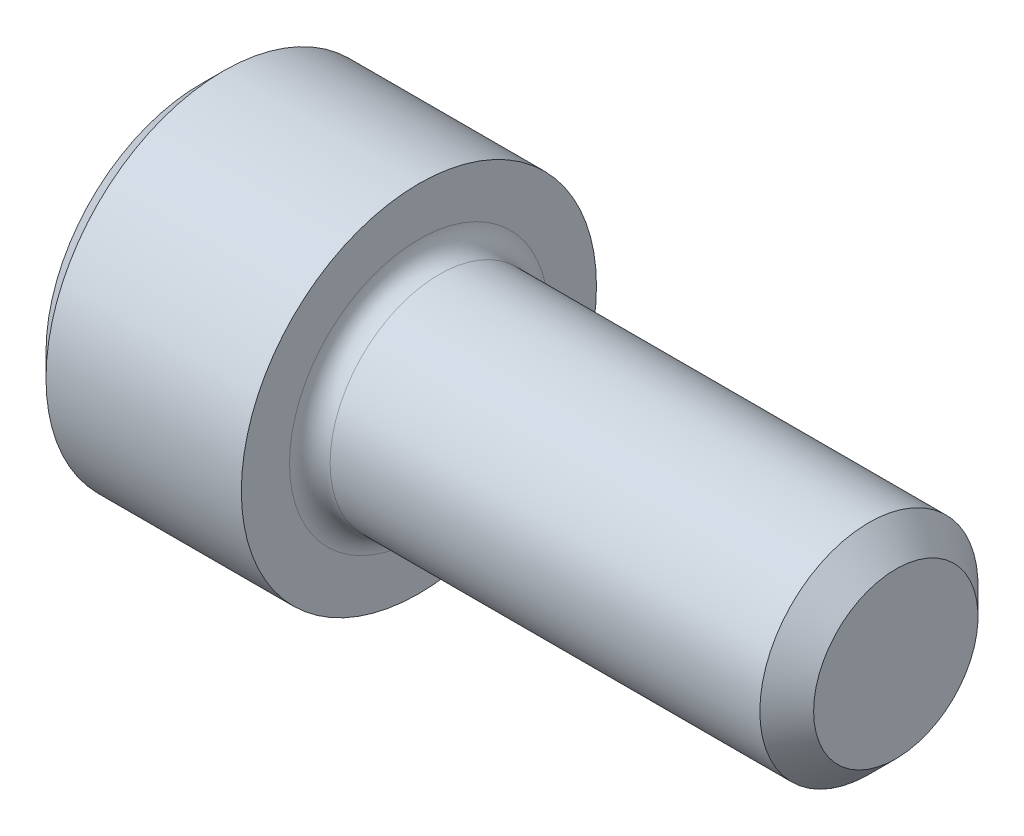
ISO-10303-21;
HEADER;
FILE_DESCRIPTION(('STEP AP214'),'2;1');
FILE_NAME('part.step','',(''),(''),'','','');
FILE_SCHEMA(('AUTOMOTIVE_DESIGN { 1 0 10303 214 1 1 1 1 }'));
ENDSEC;
DATA;
#1=APPLICATION_CONTEXT('core data for automotive mechanical design processes');
#2=APPLICATION_PROTOCOL_DEFINITION('international standard','automotive_design',2000,#1);
#3=PRODUCT_CONTEXT('',#1,'mechanical');
#4=PRODUCT('Part','Part','',(#3));
#5=PRODUCT_RELATED_PRODUCT_CATEGORY('part','',(#4));
#6=PRODUCT_DEFINITION_FORMATION('','',#4);
#7=PRODUCT_DEFINITION_CONTEXT('part definition',#1,'design');
#8=PRODUCT_DEFINITION('design','',#6,#7);
#9=PRODUCT_DEFINITION_SHAPE('','',#8);
#10=(LENGTH_UNIT() NAMED_UNIT(*) SI_UNIT(.MILLI.,.METRE.));
#11=(NAMED_UNIT(*) PLANE_ANGLE_UNIT() SI_UNIT($,.RADIAN.));
#12=(NAMED_UNIT(*) SI_UNIT($,.STERADIAN.) SOLID_ANGLE_UNIT());
#13=UNCERTAINTY_MEASURE_WITH_UNIT(LENGTH_MEASURE(1.E-05),#10,'distance_accuracy_value','');
#14=(GEOMETRIC_REPRESENTATION_CONTEXT(3) GLOBAL_UNCERTAINTY_ASSIGNED_CONTEXT((#13)) GLOBAL_UNIT_ASSIGNED_CONTEXT((#10,
#11,#12)) REPRESENTATION_CONTEXT('',''));
#15=CARTESIAN_POINT('',(0.,0.,0.));
#16=DIRECTION('',(0.,0.,1.));
#17=DIRECTION('',(1.,0.,0.));
#18=AXIS2_PLACEMENT_3D('',#15,#16,#17);
#19=CARTESIAN_POINT('',(0.,0.,0.));
#20=DIRECTION('',(-1.,0.,0.));
#21=DIRECTION('',(0.,0.,1.));
#22=AXIS2_PLACEMENT_3D('',#19,#20,#21);
#23=PLANE('',#22);
#24=DIRECTION('',(0.,-0.499999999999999,0.866025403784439));
#25=VECTOR('',#24,1.);
#26=CARTESIAN_POINT('',(0.,1.14384635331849,0.));
#27=LINE('',#26,#25);
#28=CARTESIAN_POINT('',(0.,1.14384635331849,0.));
#29=VERTEX_POINT('',#28);
#30=CARTESIAN_POINT('',(0.,0.57192317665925,0.990599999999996));
#31=VERTEX_POINT('',#30);
#32=EDGE_CURVE('E370',#29,#31,#27,.T.);
#33=ORIENTED_EDGE('',*,*,#32,.T.);
#34=DIRECTION('',(0.,1.,0.));
#35=VECTOR('',#34,1.);
#36=CARTESIAN_POINT('',(0.,-0.571923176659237,0.990599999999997));
#37=LINE('',#36,#35);
#38=CARTESIAN_POINT('',(0.,-0.571923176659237,0.990599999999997));
#39=VERTEX_POINT('',#38);
#40=EDGE_CURVE('E126',#39,#31,#37,.T.);
#41=ORIENTED_EDGE('',*,*,#40,.F.);
#42=DIRECTION('',(0.,-0.500000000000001,-0.866025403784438));
#43=VECTOR('',#42,1.);
#44=CARTESIAN_POINT('',(0.,-0.571923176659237,0.990599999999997));
#45=LINE('',#44,#43);
#46=CARTESIAN_POINT('',(0.,-1.14384635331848,0.));
#47=VERTEX_POINT('',#46);
#48=EDGE_CURVE('E373',#39,#47,#45,.T.);
#49=ORIENTED_EDGE('',*,*,#48,.T.);
#50=DIRECTION('',(0.,0.499999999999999,-0.866025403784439));
#51=VECTOR('',#50,1.);
#52=CARTESIAN_POINT('',(0.,-1.14384635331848,0.));
#53=LINE('',#52,#51);
#54=CARTESIAN_POINT('',(0.,-0.571923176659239,-0.990600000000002));
#55=VERTEX_POINT('',#54);
#56=EDGE_CURVE('E376',#47,#55,#53,.T.);
#57=ORIENTED_EDGE('',*,*,#56,.T.);
#58=DIRECTION('',(0.,-1.,0.));
#59=VECTOR('',#58,1.);
#60=CARTESIAN_POINT('',(0.,0.571923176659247,-0.990600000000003));
#61=LINE('',#60,#59);
#62=CARTESIAN_POINT('',(0.,0.571923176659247,-0.990600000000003));
#63=VERTEX_POINT('',#62);
#64=EDGE_CURVE('E379',#63,#55,#61,.T.);
#65=ORIENTED_EDGE('',*,*,#64,.F.);
#66=DIRECTION('',(0.,-0.500000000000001,-0.866025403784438));
#67=VECTOR('',#66,1.);
#68=CARTESIAN_POINT('',(0.,1.14384635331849,0.));
#69=LINE('',#68,#67);
#70=EDGE_CURVE('E121',#29,#63,#69,.T.);
#71=ORIENTED_EDGE('',*,*,#70,.F.);
#72=EDGE_LOOP('',(#33,#41,#49,#57,#65,#71));
#73=FACE_BOUND('',#72,.T.);
#74=CARTESIAN_POINT('',(0.,0.,0.));
#75=DIRECTION('',(-1.,0.,0.));
#76=DIRECTION('',(0.,0.,1.));
#77=AXIS2_PLACEMENT_3D('',#74,#75,#76);
#78=CIRCLE('',#77,1.5494);
#79=CARTESIAN_POINT('',(0.,0.,1.5494));
#80=VERTEX_POINT('',#79);
#81=EDGE_CURVE('E137',#80,#80,#78,.T.);
#82=ORIENTED_EDGE('',*,*,#81,.T.);
#83=EDGE_LOOP('',(#82));
#84=FACE_BOUND('',#83,.T.);
#85=ADVANCED_FACE('F30',(#73,#84),#23,.T.);
#86=CARTESIAN_POINT('',(6.9596,0.82296,0.));
#87=DIRECTION('',(1.,0.,0.));
#88=DIRECTION('',(0.,0.,-1.));
#89=AXIS2_PLACEMENT_3D('',#86,#87,#88);
#90=PLANE('',#89);
#91=CARTESIAN_POINT('',(6.9596,0.,0.));
#92=DIRECTION('',(-1.,0.,0.));
#93=DIRECTION('',(0.,0.,1.));
#94=AXIS2_PLACEMENT_3D('',#91,#92,#93);
#95=CIRCLE('',#94,0.82296);
#96=CARTESIAN_POINT('',(6.9596,0.,0.82296));
#97=VERTEX_POINT('',#96);
#98=EDGE_CURVE('E150',#97,#97,#95,.T.);
#99=ORIENTED_EDGE('',*,*,#98,.F.);
#100=EDGE_LOOP('',(#99));
#101=FACE_BOUND('',#100,.T.);
#102=ADVANCED_FACE('F171',(#101),#90,.T.);
#103=CARTESIAN_POINT('',(6.9596,0.,0.));
#104=DIRECTION('',(-1.,0.,0.));
#105=DIRECTION('',(0.,0.,1.));
#106=AXIS2_PLACEMENT_3D('',#103,#104,#105);
#107=CONICAL_SURFACE('',#106,0.82296,0.785398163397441);
#108=CARTESIAN_POINT('',(6.69035999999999,0.,0.));
#109=DIRECTION('',(-1.,0.,0.));
#110=DIRECTION('',(0.,0.,1.));
#111=AXIS2_PLACEMENT_3D('',#108,#109,#110);
#112=CIRCLE('',#111,1.0922);
#113=CARTESIAN_POINT('',(6.69035999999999,0.,1.0922));
#114=VERTEX_POINT('',#113);
#115=EDGE_CURVE('E147',#114,#114,#112,.T.);
#116=ORIENTED_EDGE('',*,*,#115,.F.);
#117=EDGE_LOOP('',(#116));
#118=FACE_BOUND('',#117,.T.);
#119=ORIENTED_EDGE('',*,*,#98,.T.);
#120=EDGE_LOOP('',(#119));
#121=FACE_BOUND('',#120,.T.);
#122=ADVANCED_FACE('F177',(#118,#121),#107,.T.);
#123=CARTESIAN_POINT('',(-31.75,0.,0.));
#124=DIRECTION('',(-1.,0.,0.));
#125=DIRECTION('',(0.,0.,1.));
#126=AXIS2_PLACEMENT_3D('',#123,#124,#125);
#127=CYLINDRICAL_SURFACE('',#126,1.0922);
#128=CARTESIAN_POINT('',(2.3876,0.,0.));
#129=DIRECTION('',(1.,0.,0.));
#130=DIRECTION('',(0.,0.,-1.));
#131=AXIS2_PLACEMENT_3D('',#128,#129,#130);
#132=CIRCLE('',#131,1.0922);
#133=CARTESIAN_POINT('',(2.3876,0.,-1.0922));
#134=VERTEX_POINT('',#133);
#135=EDGE_CURVE('E11',#134,#134,#132,.T.);
#136=ORIENTED_EDGE('',*,*,#135,.T.);
#137=EDGE_LOOP('',(#136));
#138=FACE_BOUND('',#137,.T.);
#139=ORIENTED_EDGE('',*,*,#115,.T.);
#140=EDGE_LOOP('',(#139));
#141=FACE_BOUND('',#140,.T.);
#142=ADVANCED_FACE('F188',(#138,#141),#127,.T.);
#143=CARTESIAN_POINT('',(2.1844,1.778,0.));
#144=DIRECTION('',(1.,0.,0.));
#145=DIRECTION('',(0.,0.,-1.));
#146=AXIS2_PLACEMENT_3D('',#143,#144,#145);
#147=PLANE('',#146);
#148=CARTESIAN_POINT('',(2.1844,0.,0.));
#149=DIRECTION('',(1.,0.,0.));
#150=DIRECTION('',(0.,0.,-1.));
#151=AXIS2_PLACEMENT_3D('',#148,#149,#150);
#152=CIRCLE('',#151,1.2954);
#153=CARTESIAN_POINT('',(2.1844,0.,-1.2954));
#154=VERTEX_POINT('',#153);
#155=EDGE_CURVE('E38',#154,#154,#152,.F.);
#156=ORIENTED_EDGE('',*,*,#155,.T.);
#157=EDGE_LOOP('',(#156));
#158=FACE_BOUND('',#157,.T.);
#159=CARTESIAN_POINT('',(2.1844,0.,0.));
#160=DIRECTION('',(-1.,0.,0.));
#161=DIRECTION('',(0.,0.,1.));
#162=AXIS2_PLACEMENT_3D('',#159,#160,#161);
#163=CIRCLE('',#162,1.778);
#164=CARTESIAN_POINT('',(2.1844,0.,1.778));
#165=VERTEX_POINT('',#164);
#166=EDGE_CURVE('E144',#165,#165,#163,.T.);
#167=ORIENTED_EDGE('',*,*,#166,.F.);
#168=EDGE_LOOP('',(#167));
#169=FACE_BOUND('',#168,.T.);
#170=ADVANCED_FACE('F155',(#158,#169),#147,.T.);
#171=CARTESIAN_POINT('',(-31.75,0.,0.));
#172=DIRECTION('',(-1.,0.,0.));
#173=DIRECTION('',(0.,0.,1.));
#174=AXIS2_PLACEMENT_3D('',#171,#172,#173);
#175=CYLINDRICAL_SURFACE('',#174,1.778);
#176=ORIENTED_EDGE('',*,*,#166,.T.);
#177=EDGE_LOOP('',(#176));
#178=FACE_BOUND('',#177,.T.);
#179=CARTESIAN_POINT('',(0.228600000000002,0.,0.));
#180=DIRECTION('',(-1.,0.,0.));
#181=DIRECTION('',(0.,0.,1.));
#182=AXIS2_PLACEMENT_3D('',#179,#180,#181);
#183=CIRCLE('',#182,1.778);
#184=CARTESIAN_POINT('',(0.228600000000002,0.,1.778));
#185=VERTEX_POINT('',#184);
#186=EDGE_CURVE('E141',#185,#185,#183,.T.);
#187=ORIENTED_EDGE('',*,*,#186,.F.);
#188=EDGE_LOOP('',(#187));
#189=FACE_BOUND('',#188,.T.);
#190=ADVANCED_FACE('F166',(#178,#189),#175,.T.);
#191=CARTESIAN_POINT('',(0.,0.,0.));
#192=DIRECTION('',(1.,0.,0.));
#193=DIRECTION('',(0.,0.,-1.));
#194=AXIS2_PLACEMENT_3D('',#191,#192,#193);
#195=CONICAL_SURFACE('',#194,1.5494,0.785398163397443);
#196=ORIENTED_EDGE('',*,*,#186,.T.);
#197=EDGE_LOOP('',(#196));
#198=FACE_BOUND('',#197,.T.);
#199=ORIENTED_EDGE('',*,*,#81,.F.);
#200=EDGE_LOOP('',(#199));
#201=FACE_BOUND('',#200,.T.);
#202=ADVANCED_FACE('F159',(#198,#201),#195,.T.);
#203=CARTESIAN_POINT('',(2.3876,0.,0.));
#204=DIRECTION('',(1.,0.,0.));
#205=DIRECTION('',(0.,0.,-1.));
#206=AXIS2_PLACEMENT_3D('',#203,#204,#205);
#207=TOROIDAL_SURFACE('',#206,1.2954,0.2032);
#208=ORIENTED_EDGE('',*,*,#135,.F.);
#209=EDGE_LOOP('',(#208));
#210=FACE_BOUND('',#209,.T.);
#211=ORIENTED_EDGE('',*,*,#155,.F.);
#212=EDGE_LOOP('',(#211));
#213=FACE_BOUND('',#212,.T.);
#214=ADVANCED_FACE('F32',(#210,#213),#207,.F.);
#215=CARTESIAN_POINT('',(0.9652,1.14384635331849,0.));
#216=DIRECTION('',(0.,-0.866025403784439,-0.499999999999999));
#217=DIRECTION('',(0.,0.499999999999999,-0.866025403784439));
#218=AXIS2_PLACEMENT_3D('',#215,#216,#217);
#219=PLANE('',#218);
#220=ORIENTED_EDGE('',*,*,#32,.F.);
#221=DIRECTION('',(-1.,0.,0.));
#222=VECTOR('',#221,1.);
#223=CARTESIAN_POINT('',(0.9652,1.14384635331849,0.));
#224=LINE('',#223,#222);
#225=CARTESIAN_POINT('',(0.9652,1.14384635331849,0.));
#226=VERTEX_POINT('',#225);
#227=EDGE_CURVE('E360',#226,#29,#224,.T.);
#228=ORIENTED_EDGE('',*,*,#227,.F.);
#229=DIRECTION('',(0.,-0.499999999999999,0.866025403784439));
#230=VECTOR('',#229,1.);
#231=CARTESIAN_POINT('',(0.9652,1.14384635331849,0.));
#232=LINE('',#231,#230);
#233=CARTESIAN_POINT('',(0.9652,0.857884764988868,0.495300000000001));
#234=VERTEX_POINT('',#233);
#235=EDGE_CURVE('E113',#226,#234,#232,.T.);
#236=ORIENTED_EDGE('',*,*,#235,.T.);
#237=CARTESIAN_POINT('',(0.9652,0.57192317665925,0.990599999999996));
#238=VERTEX_POINT('',#237);
#239=EDGE_CURVE('E104',#234,#238,#232,.T.);
#240=ORIENTED_EDGE('',*,*,#239,.T.);
#241=DIRECTION('',(-1.,0.,0.));
#242=VECTOR('',#241,1.);
#243=CARTESIAN_POINT('',(0.9652,0.57192317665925,0.990599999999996));
#244=LINE('',#243,#242);
#245=EDGE_CURVE('E118',#238,#31,#244,.T.);
#246=ORIENTED_EDGE('',*,*,#245,.T.);
#247=EDGE_LOOP('',(#220,#228,#236,#240,#246));
#248=FACE_BOUND('',#247,.T.);
#249=ADVANCED_FACE('F117',(#248),#219,.T.);
#250=CARTESIAN_POINT('',(0.9652,-0.571923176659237,0.990599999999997));
#251=DIRECTION('',(0.,0.,1.));
#252=DIRECTION('',(0.,-1.,0.));
#253=AXIS2_PLACEMENT_3D('',#250,#251,#252);
#254=PLANE('',#253);
#255=ORIENTED_EDGE('',*,*,#40,.T.);
#256=ORIENTED_EDGE('',*,*,#245,.F.);
#257=DIRECTION('',(0.,1.,0.));
#258=VECTOR('',#257,1.);
#259=CARTESIAN_POINT('',(0.9652,-0.571923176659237,0.990599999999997));
#260=LINE('',#259,#258);
#261=CARTESIAN_POINT('',(0.9652,0.,0.990599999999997));
#262=VERTEX_POINT('',#261);
#263=EDGE_CURVE('E101',#262,#238,#260,.T.);
#264=ORIENTED_EDGE('',*,*,#263,.F.);
#265=CARTESIAN_POINT('',(0.9652,-0.571923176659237,0.990599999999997));
#266=VERTEX_POINT('',#265);
#267=EDGE_CURVE('E112',#266,#262,#260,.T.);
#268=ORIENTED_EDGE('',*,*,#267,.F.);
#269=DIRECTION('',(-1.,0.,0.));
#270=VECTOR('',#269,1.);
#271=CARTESIAN_POINT('',(0.9652,-0.571923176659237,0.990599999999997));
#272=LINE('',#271,#270);
#273=EDGE_CURVE('E128',#266,#39,#272,.T.);
#274=ORIENTED_EDGE('',*,*,#273,.T.);
#275=EDGE_LOOP('',(#255,#256,#264,#268,#274));
#276=FACE_BOUND('',#275,.T.);
#277=ADVANCED_FACE('F123',(#276),#254,.F.);
#278=CARTESIAN_POINT('',(0.9652,-0.571923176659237,0.990599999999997));
#279=DIRECTION('',(0.,0.866025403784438,-0.500000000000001));
#280=DIRECTION('',(0.,0.500000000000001,0.866025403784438));
#281=AXIS2_PLACEMENT_3D('',#278,#279,#280);
#282=PLANE('',#281);
#283=ORIENTED_EDGE('',*,*,#48,.F.);
#284=ORIENTED_EDGE('',*,*,#273,.F.);
#285=DIRECTION('',(0.,-0.500000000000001,-0.866025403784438));
#286=VECTOR('',#285,1.);
#287=CARTESIAN_POINT('',(0.9652,-0.571923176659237,0.990599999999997));
#288=LINE('',#287,#286);
#289=CARTESIAN_POINT('',(0.9652,-0.857884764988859,0.495299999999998));
#290=VERTEX_POINT('',#289);
#291=EDGE_CURVE('E399',#266,#290,#288,.T.);
#292=ORIENTED_EDGE('',*,*,#291,.T.);
#293=CARTESIAN_POINT('',(0.9652,-1.14384635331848,0.));
#294=VERTEX_POINT('',#293);
#295=EDGE_CURVE('E388',#290,#294,#288,.T.);
#296=ORIENTED_EDGE('',*,*,#295,.T.);
#297=DIRECTION('',(-1.,0.,0.));
#298=VECTOR('',#297,1.);
#299=CARTESIAN_POINT('',(0.9652,-1.14384635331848,0.));
#300=LINE('',#299,#298);
#301=EDGE_CURVE('E133',#294,#47,#300,.T.);
#302=ORIENTED_EDGE('',*,*,#301,.T.);
#303=EDGE_LOOP('',(#283,#284,#292,#296,#302));
#304=FACE_BOUND('',#303,.T.);
#305=ADVANCED_FACE('F251',(#304),#282,.T.);
#306=CARTESIAN_POINT('',(0.9652,-1.14384635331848,0.));
#307=DIRECTION('',(0.,0.866025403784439,0.499999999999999));
#308=DIRECTION('',(0.,-0.499999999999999,0.866025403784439));
#309=AXIS2_PLACEMENT_3D('',#306,#307,#308);
#310=PLANE('',#309);
#311=ORIENTED_EDGE('',*,*,#56,.F.);
#312=ORIENTED_EDGE('',*,*,#301,.F.);
#313=DIRECTION('',(0.,0.499999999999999,-0.866025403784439));
#314=VECTOR('',#313,1.);
#315=CARTESIAN_POINT('',(0.9652,-1.14384635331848,0.));
#316=LINE('',#315,#314);
#317=CARTESIAN_POINT('',(0.9652,-0.857884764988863,-0.495299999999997));
#318=VERTEX_POINT('',#317);
#319=EDGE_CURVE('E366',#294,#318,#316,.T.);
#320=ORIENTED_EDGE('',*,*,#319,.T.);
#321=CARTESIAN_POINT('',(0.9652,-0.571923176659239,-0.990600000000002));
#322=VERTEX_POINT('',#321);
#323=EDGE_CURVE('E398',#318,#322,#316,.T.);
#324=ORIENTED_EDGE('',*,*,#323,.T.);
#325=DIRECTION('',(-1.,0.,0.));
#326=VECTOR('',#325,1.);
#327=CARTESIAN_POINT('',(0.9652,-0.571923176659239,-0.990600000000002));
#328=LINE('',#327,#326);
#329=EDGE_CURVE('E359',#322,#55,#328,.T.);
#330=ORIENTED_EDGE('',*,*,#329,.T.);
#331=EDGE_LOOP('',(#311,#312,#320,#324,#330));
#332=FACE_BOUND('',#331,.T.);
#333=ADVANCED_FACE('F259',(#332),#310,.T.);
#334=CARTESIAN_POINT('',(0.9652,0.571923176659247,-0.990600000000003));
#335=DIRECTION('',(0.,0.,-1.));
#336=DIRECTION('',(0.,1.,0.));
#337=AXIS2_PLACEMENT_3D('',#334,#335,#336);
#338=PLANE('',#337);
#339=ORIENTED_EDGE('',*,*,#64,.T.);
#340=ORIENTED_EDGE('',*,*,#329,.F.);
#341=DIRECTION('',(0.,-1.,0.));
#342=VECTOR('',#341,1.);
#343=CARTESIAN_POINT('',(0.9652,0.571923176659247,-0.990600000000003));
#344=LINE('',#343,#342);
#345=CARTESIAN_POINT('',(0.965200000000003,0.,-0.9906));
#346=VERTEX_POINT('',#345);
#347=EDGE_CURVE('E363',#346,#322,#344,.T.);
#348=ORIENTED_EDGE('',*,*,#347,.F.);
#349=CARTESIAN_POINT('',(0.9652,0.571923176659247,-0.990600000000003));
#350=VERTEX_POINT('',#349);
#351=EDGE_CURVE('E45',#350,#346,#344,.T.);
#352=ORIENTED_EDGE('',*,*,#351,.F.);
#353=DIRECTION('',(-1.,0.,0.));
#354=VECTOR('',#353,1.);
#355=CARTESIAN_POINT('',(0.9652,0.571923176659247,-0.990600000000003));
#356=LINE('',#355,#354);
#357=EDGE_CURVE('E356',#350,#63,#356,.T.);
#358=ORIENTED_EDGE('',*,*,#357,.T.);
#359=EDGE_LOOP('',(#339,#340,#348,#352,#358));
#360=FACE_BOUND('',#359,.T.);
#361=ADVANCED_FACE('F268',(#360),#338,.F.);
#362=CARTESIAN_POINT('',(0.9652,1.14384635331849,0.));
#363=DIRECTION('',(0.,0.866025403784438,-0.500000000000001));
#364=DIRECTION('',(0.,0.500000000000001,0.866025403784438));
#365=AXIS2_PLACEMENT_3D('',#362,#363,#364);
#366=PLANE('',#365);
#367=ORIENTED_EDGE('',*,*,#70,.T.);
#368=ORIENTED_EDGE('',*,*,#357,.F.);
#369=DIRECTION('',(0.,-0.500000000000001,-0.866025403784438));
#370=VECTOR('',#369,1.);
#371=CARTESIAN_POINT('',(0.9652,1.14384635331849,0.));
#372=LINE('',#371,#370);
#373=CARTESIAN_POINT('',(0.9652,0.857884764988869,-0.495300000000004));
#374=VERTEX_POINT('',#373);
#375=EDGE_CURVE('E346',#374,#350,#372,.T.);
#376=ORIENTED_EDGE('',*,*,#375,.F.);
#377=EDGE_CURVE('E352',#226,#374,#372,.T.);
#378=ORIENTED_EDGE('',*,*,#377,.F.);
#379=ORIENTED_EDGE('',*,*,#227,.T.);
#380=EDGE_LOOP('',(#367,#368,#376,#378,#379));
#381=FACE_BOUND('',#380,.T.);
#382=ADVANCED_FACE('F277',(#381),#366,.F.);
#383=CARTESIAN_POINT('',(0.9652,1.14384635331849,0.));
#384=DIRECTION('',(1.,0.,0.));
#385=DIRECTION('',(0.,0.,-1.));
#386=AXIS2_PLACEMENT_3D('',#383,#384,#385);
#387=PLANE('',#386);
#388=ORIENTED_EDGE('',*,*,#347,.T.);
#389=ORIENTED_EDGE('',*,*,#323,.F.);
#390=CARTESIAN_POINT('',(0.965200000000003,0.,0.));
#391=DIRECTION('',(-1.,0.,0.));
#392=DIRECTION('',(0.,0.,1.));
#393=AXIS2_PLACEMENT_3D('',#390,#391,#392);
#394=CIRCLE('',#393,0.9906);
#395=EDGE_CURVE('E394',#346,#318,#394,.T.);
#396=ORIENTED_EDGE('',*,*,#395,.F.);
#397=EDGE_LOOP('',(#388,#389,#396));
#398=FACE_BOUND('',#397,.T.);
#399=ADVANCED_FACE('F286',(#398),#387,.F.);
#400=ORIENTED_EDGE('',*,*,#319,.F.);
#401=ORIENTED_EDGE('',*,*,#295,.F.);
#402=EDGE_CURVE('E131',#318,#290,#394,.T.);
#403=ORIENTED_EDGE('',*,*,#402,.F.);
#404=EDGE_LOOP('',(#400,#401,#403));
#405=FACE_BOUND('',#404,.T.);
#406=ADVANCED_FACE('F295',(#405),#387,.F.);
#407=ORIENTED_EDGE('',*,*,#291,.F.);
#408=ORIENTED_EDGE('',*,*,#267,.T.);
#409=EDGE_CURVE('E127',#290,#262,#394,.T.);
#410=ORIENTED_EDGE('',*,*,#409,.F.);
#411=EDGE_LOOP('',(#407,#408,#410));
#412=FACE_BOUND('',#411,.T.);
#413=ADVANCED_FACE('F304',(#412),#387,.F.);
#414=ORIENTED_EDGE('',*,*,#263,.T.);
#415=ORIENTED_EDGE('',*,*,#239,.F.);
#416=EDGE_CURVE('E107',#262,#234,#394,.T.);
#417=ORIENTED_EDGE('',*,*,#416,.F.);
#418=EDGE_LOOP('',(#414,#415,#417));
#419=FACE_BOUND('',#418,.T.);
#420=ADVANCED_FACE('F103',(#419),#387,.F.);
#421=ORIENTED_EDGE('',*,*,#235,.F.);
#422=ORIENTED_EDGE('',*,*,#377,.T.);
#423=EDGE_CURVE('E138',#234,#374,#394,.T.);
#424=ORIENTED_EDGE('',*,*,#423,.F.);
#425=EDGE_LOOP('',(#421,#422,#424));
#426=FACE_BOUND('',#425,.T.);
#427=ADVANCED_FACE('F319',(#426),#387,.F.);
#428=ORIENTED_EDGE('',*,*,#375,.T.);
#429=ORIENTED_EDGE('',*,*,#351,.T.);
#430=EDGE_CURVE('E349',#374,#346,#394,.T.);
#431=ORIENTED_EDGE('',*,*,#430,.F.);
#432=EDGE_LOOP('',(#428,#429,#431));
#433=FACE_BOUND('',#432,.T.);
#434=ADVANCED_FACE('F234',(#433),#387,.F.);
#435=CARTESIAN_POINT('',(0.965200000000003,0.,0.));
#436=DIRECTION('',(-1.,0.,0.));
#437=DIRECTION('',(0.,0.,1.));
#438=AXIS2_PLACEMENT_3D('',#435,#436,#437);
#439=CONICAL_SURFACE('',#438,0.9906,1.04719755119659);
#440=CARTESIAN_POINT('',(1.53712317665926,0.,0.));
#441=VERTEX_POINT('',#440);
#442=VERTEX_LOOP('',#441);
#443=FACE_BOUND('',#442,.T.);
#444=ORIENTED_EDGE('',*,*,#416,.T.);
#445=ORIENTED_EDGE('',*,*,#423,.T.);
#446=ORIENTED_EDGE('',*,*,#430,.T.);
#447=ORIENTED_EDGE('',*,*,#395,.T.);
#448=ORIENTED_EDGE('',*,*,#402,.T.);
#449=ORIENTED_EDGE('',*,*,#409,.T.);
#450=EDGE_LOOP('',(#444,#445,#446,#447,#448,#449));
#451=FACE_BOUND('',#450,.T.);
#452=ADVANCED_FACE('F181',(#443,#451),#439,.F.);
#453=CLOSED_SHELL('',(#85,#102,#122,#142,#170,#190,#202,#214,#249,#277,#305,#333,#361,#382,#399,
#406,#413,#420,#427,#434,#452));
#454=MANIFOLD_SOLID_BREP('B2',#453);
#455=ADVANCED_BREP_SHAPE_REPRESENTATION('',(#18,#454),#14);
#456=SHAPE_DEFINITION_REPRESENTATION(#9,#455);
ENDSEC;
END-ISO-10303-21;
